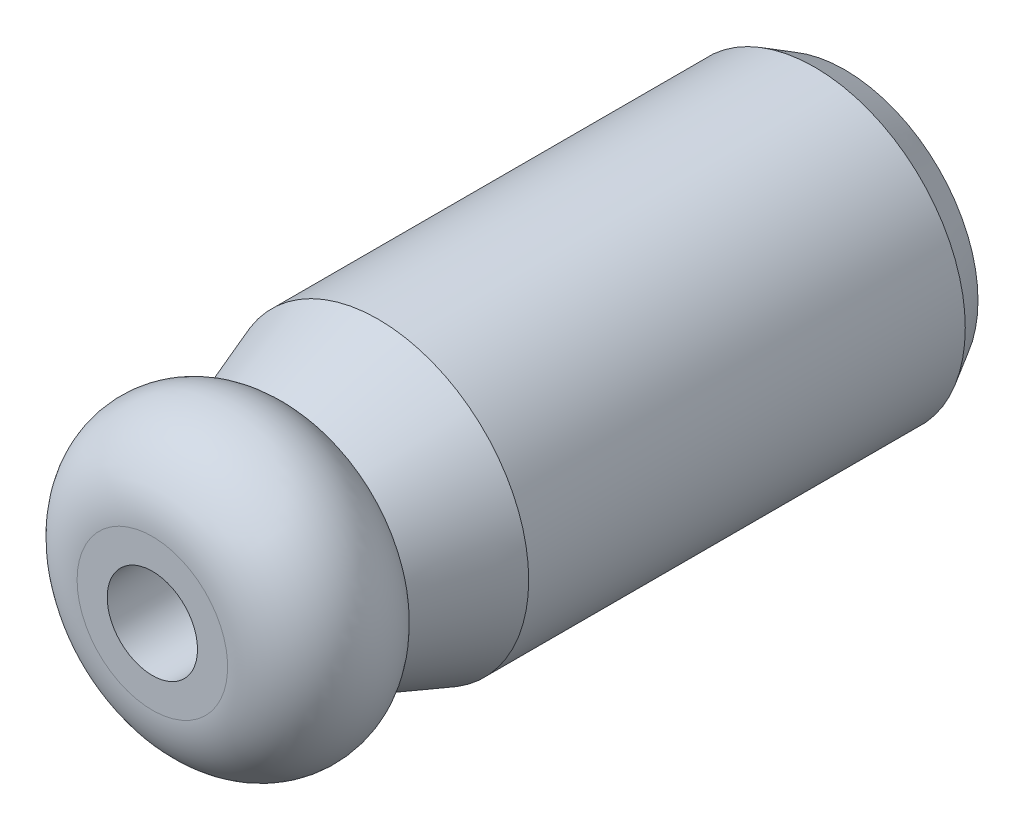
ISO-10303-21;
HEADER;
FILE_DESCRIPTION(('STEP AP214'),'2;1');
FILE_NAME('part.step','',(''),(''),'','','');
FILE_SCHEMA(('AUTOMOTIVE_DESIGN { 1 0 10303 214 1 1 1 1 }'));
ENDSEC;
DATA;
#1=APPLICATION_CONTEXT('core data for automotive mechanical design processes');
#2=APPLICATION_PROTOCOL_DEFINITION('international standard','automotive_design',2000,#1);
#3=PRODUCT_CONTEXT('',#1,'mechanical');
#4=PRODUCT('Part','Part','',(#3));
#5=PRODUCT_RELATED_PRODUCT_CATEGORY('part','',(#4));
#6=PRODUCT_DEFINITION_FORMATION('','',#4);
#7=PRODUCT_DEFINITION_CONTEXT('part definition',#1,'design');
#8=PRODUCT_DEFINITION('design','',#6,#7);
#9=PRODUCT_DEFINITION_SHAPE('','',#8);
#10=(LENGTH_UNIT() NAMED_UNIT(*) SI_UNIT(.MILLI.,.METRE.));
#11=(NAMED_UNIT(*) PLANE_ANGLE_UNIT() SI_UNIT($,.RADIAN.));
#12=(NAMED_UNIT(*) SI_UNIT($,.STERADIAN.) SOLID_ANGLE_UNIT());
#13=UNCERTAINTY_MEASURE_WITH_UNIT(LENGTH_MEASURE(1.E-05),#10,'distance_accuracy_value','');
#14=(GEOMETRIC_REPRESENTATION_CONTEXT(3) GLOBAL_UNCERTAINTY_ASSIGNED_CONTEXT((#13)) GLOBAL_UNIT_ASSIGNED_CONTEXT((#10,
#11,#12)) REPRESENTATION_CONTEXT('',''));
#15=CARTESIAN_POINT('',(0.,0.,0.));
#16=DIRECTION('',(0.,0.,1.));
#17=DIRECTION('',(1.,0.,0.));
#18=AXIS2_PLACEMENT_3D('',#15,#16,#17);
#19=CARTESIAN_POINT('',(-4.4757218,-4.491122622,0.));
#20=DIRECTION('',(0.,0.,1.));
#21=DIRECTION('',(1.,0.,0.));
#22=AXIS2_PLACEMENT_3D('',#19,#20,#21);
#23=PLANE('',#22);
#24=CARTESIAN_POINT('',(0.,0.,0.));
#25=DIRECTION('',(0.,0.,1.));
#26=DIRECTION('',(1.,0.,0.));
#27=AXIS2_PLACEMENT_3D('',#24,#25,#26);
#28=CIRCLE('',#27,4.42265);
#29=CARTESIAN_POINT('',(4.42265,0.,0.));
#30=VERTEX_POINT('',#29);
#31=EDGE_CURVE('E16',#30,#30,#28,.T.);
#32=ORIENTED_EDGE('',*,*,#31,.F.);
#33=EDGE_LOOP('',(#32));
#34=FACE_BOUND('',#33,.T.);
#35=ADVANCED_FACE('F12',(#34),#23,.F.);
#36=CARTESIAN_POINT('',(0.,0.,0.));
#37=DIRECTION('',(0.,0.,1.));
#38=DIRECTION('',(1.,0.,0.));
#39=AXIS2_PLACEMENT_3D('',#36,#37,#38);
#40=CONICAL_SURFACE('',#39,4.42265,0.523598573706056);
#41=CARTESIAN_POINT('',(0.,0.,1.));
#42=DIRECTION('',(0.,0.,-1.));
#43=DIRECTION('',(-1.,0.,0.));
#44=AXIS2_PLACEMENT_3D('',#41,#42,#43);
#45=CIRCLE('',#44,5.);
#46=CARTESIAN_POINT('',(-5.,0.,1.));
#47=VERTEX_POINT('',#46);
#48=EDGE_CURVE('E28',#47,#47,#45,.F.);
#49=ORIENTED_EDGE('',*,*,#48,.F.);
#50=EDGE_LOOP('',(#49));
#51=FACE_BOUND('',#50,.T.);
#52=ORIENTED_EDGE('',*,*,#31,.T.);
#53=EDGE_LOOP('',(#52));
#54=FACE_BOUND('',#53,.T.);
#55=ADVANCED_FACE('F48',(#51,#54),#40,.T.);
#56=CARTESIAN_POINT('',(0.,0.,15.5));
#57=DIRECTION('',(0.,0.,-1.));
#58=DIRECTION('',(-1.,0.,0.));
#59=AXIS2_PLACEMENT_3D('',#56,#57,#58);
#60=CYLINDRICAL_SURFACE('',#59,5.);
#61=ORIENTED_EDGE('',*,*,#48,.T.);
#62=EDGE_LOOP('',(#61));
#63=FACE_BOUND('',#62,.T.);
#64=CARTESIAN_POINT('',(0.,0.,15.5));
#65=DIRECTION('',(0.,0.,-1.));
#66=DIRECTION('',(-1.,0.,0.));
#67=AXIS2_PLACEMENT_3D('',#64,#65,#66);
#68=CIRCLE('',#67,5.);
#69=CARTESIAN_POINT('',(-5.,0.,15.5));
#70=VERTEX_POINT('',#69);
#71=EDGE_CURVE('E35',#70,#70,#68,.F.);
#72=ORIENTED_EDGE('',*,*,#71,.F.);
#73=EDGE_LOOP('',(#72));
#74=FACE_BOUND('',#73,.T.);
#75=ADVANCED_FACE('F56',(#63,#74),#60,.T.);
#76=CARTESIAN_POINT('',(0.,0.,18.447432));
#77=DIRECTION('',(0.,0.,-1.));
#78=DIRECTION('',(-1.,0.,0.));
#79=AXIS2_PLACEMENT_3D('',#76,#77,#78);
#80=CONICAL_SURFACE('',#79,3.927223,0.349065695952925);
#81=ORIENTED_EDGE('',*,*,#71,.T.);
#82=EDGE_LOOP('',(#81));
#83=FACE_BOUND('',#82,.T.);
#84=CARTESIAN_POINT('',(0.,0.,18.447432));
#85=DIRECTION('',(0.,0.,1.));
#86=DIRECTION('',(1.,0.,0.));
#87=AXIS2_PLACEMENT_3D('',#84,#85,#86);
#88=CIRCLE('',#87,3.927223);
#89=CARTESIAN_POINT('',(3.927223,0.,18.447432));
#90=VERTEX_POINT('',#89);
#91=EDGE_CURVE('E31',#90,#90,#88,.T.);
#92=ORIENTED_EDGE('',*,*,#91,.F.);
#93=EDGE_LOOP('',(#92));
#94=FACE_BOUND('',#93,.T.);
#95=ADVANCED_FACE('F71',(#83,#94),#80,.T.);
#96=CARTESIAN_POINT('',(0.,0.,20.4999999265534));
#97=DIRECTION('',(0.,0.,-1.));
#98=DIRECTION('',(-1.,0.,0.));
#99=AXIS2_PLACEMENT_3D('',#96,#97,#98);
#100=DEGENERATE_TOROIDAL_SURFACE('',#99,2.500000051,2.5000000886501,.T.);
#101=ORIENTED_EDGE('',*,*,#91,.T.);
#102=EDGE_LOOP('',(#101));
#103=FACE_BOUND('',#102,.T.);
#104=CARTESIAN_POINT('',(0.,0.,23.0000000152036));
#105=DIRECTION('',(0.,0.,-1.));
#106=DIRECTION('',(-1.,0.,0.));
#107=AXIS2_PLACEMENT_3D('',#104,#105,#106);
#108=CIRCLE('',#107,2.50000004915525);
#109=CARTESIAN_POINT('',(-2.50000004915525,0.,23.0000000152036));
#110=VERTEX_POINT('',#109);
#111=EDGE_CURVE('E25',#110,#110,#108,.T.);
#112=ORIENTED_EDGE('',*,*,#111,.T.);
#113=EDGE_LOOP('',(#112));
#114=FACE_BOUND('',#113,.T.);
#115=ADVANCED_FACE('F74',(#103,#114),#100,.T.);
#116=CARTESIAN_POINT('',(2.530000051,-2.538705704,23.000000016));
#117=DIRECTION('',(0.,0.,-1.));
#118=DIRECTION('',(-1.,0.,0.));
#119=AXIS2_PLACEMENT_3D('',#116,#117,#118);
#120=PLANE('',#119);
#121=CARTESIAN_POINT('',(0.,0.,23.000000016));
#122=DIRECTION('',(0.,0.,1.));
#123=DIRECTION('',(1.,0.,0.));
#124=AXIS2_PLACEMENT_3D('',#121,#122,#123);
#125=CIRCLE('',#124,1.5);
#126=CARTESIAN_POINT('',(1.5,0.,23.000000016));
#127=VERTEX_POINT('',#126);
#128=EDGE_CURVE('E20',#127,#127,#125,.F.);
#129=ORIENTED_EDGE('',*,*,#128,.T.);
#130=EDGE_LOOP('',(#129));
#131=FACE_BOUND('',#130,.T.);
#132=ORIENTED_EDGE('',*,*,#111,.F.);
#133=EDGE_LOOP('',(#132));
#134=FACE_BOUND('',#133,.T.);
#135=ADVANCED_FACE('F67',(#131,#134),#120,.F.);
#136=CARTESIAN_POINT('',(-1.518,-1.523223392,17.000000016));
#137=DIRECTION('',(0.,0.,1.));
#138=DIRECTION('',(1.,0.,0.));
#139=AXIS2_PLACEMENT_3D('',#136,#137,#138);
#140=PLANE('',#139);
#141=CARTESIAN_POINT('',(0.,0.,17.000000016));
#142=DIRECTION('',(0.,0.,1.));
#143=DIRECTION('',(1.,0.,0.));
#144=AXIS2_PLACEMENT_3D('',#141,#142,#143);
#145=CIRCLE('',#144,1.5);
#146=CARTESIAN_POINT('',(1.5,0.,17.000000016));
#147=VERTEX_POINT('',#146);
#148=EDGE_CURVE('E8',#147,#147,#145,.T.);
#149=ORIENTED_EDGE('',*,*,#148,.T.);
#150=EDGE_LOOP('',(#149));
#151=FACE_BOUND('',#150,.T.);
#152=ADVANCED_FACE('F14',(#151),#140,.T.);
#153=CARTESIAN_POINT('',(0.,0.,17.000000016));
#154=DIRECTION('',(0.,0.,1.));
#155=DIRECTION('',(1.,0.,0.));
#156=AXIS2_PLACEMENT_3D('',#153,#154,#155);
#157=CYLINDRICAL_SURFACE('',#156,1.5);
#158=ORIENTED_EDGE('',*,*,#128,.F.);
#159=EDGE_LOOP('',(#158));
#160=FACE_BOUND('',#159,.T.);
#161=ORIENTED_EDGE('',*,*,#148,.F.);
#162=EDGE_LOOP('',(#161));
#163=FACE_BOUND('',#162,.T.);
#164=ADVANCED_FACE('F61',(#160,#163),#157,.F.);
#165=CLOSED_SHELL('',(#35,#55,#75,#95,#115,#135,#152,#164));
#166=MANIFOLD_SOLID_BREP('B1',#165);
#167=ADVANCED_BREP_SHAPE_REPRESENTATION('',(#18,#166),#14);
#168=SHAPE_DEFINITION_REPRESENTATION(#9,#167);
ENDSEC;
END-ISO-10303-21;
